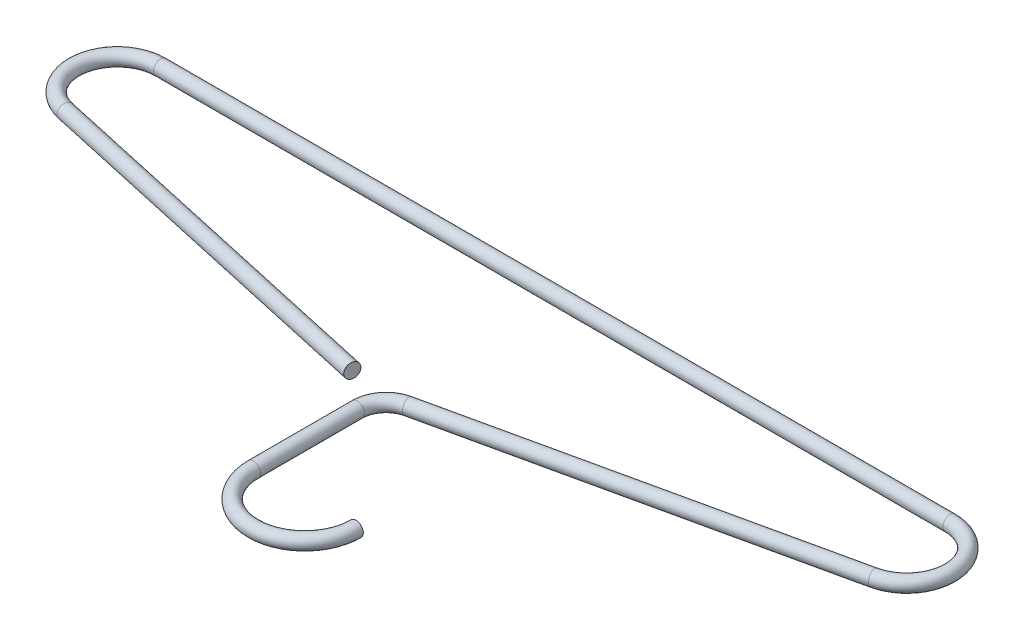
from build123d import *

# Parameters (mm, degrees)
SKETCH2_R = 3.175


with BuildPart() as part:
    # Sweep1: sweep along a path in Sketch1
    with BuildLine(Plane.XZ) as sweep1_path:
        Line((-15.877829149, -4.311433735), (-177.807440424, -40.12850914))
        ThreePointArc((-177.807440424, -40.12850914), (-192.63050064, -60.79828413), (-173.693228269, -77.778932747))
        Line((-173.693228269, -77.778932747), (173.693228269, -77.778932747))
        ThreePointArc((173.693228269, -77.778932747), (192.63050064, -60.79828413), (177.807440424, -40.12850914))
        Line((177.807440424, -40.12850914), (9.957191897, -3.001852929))
        ThreePointArc((9.957191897, -3.001852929), (2.797382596, 1.446815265), (0, 9.398429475))
        Line((0, 9.398429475), (0, 55.109156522))
        ThreePointArc((0, 55.109156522), (22.608503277, 77.717659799), (45.217006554, 55.109156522))
    # Sketch2 → Sweep1 (sweep)
    with BuildSketch(Plane(origin=(-15.877829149, 0, -4.311433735), x_dir=(0.21590756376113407, 0.023878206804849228, -0.9761217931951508), z_dir=(0.9764001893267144, 0, 0.21596914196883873))):
        Circle(SKETCH2_R)
    sweep(path=sweep1_path.line)


solid = part.part
